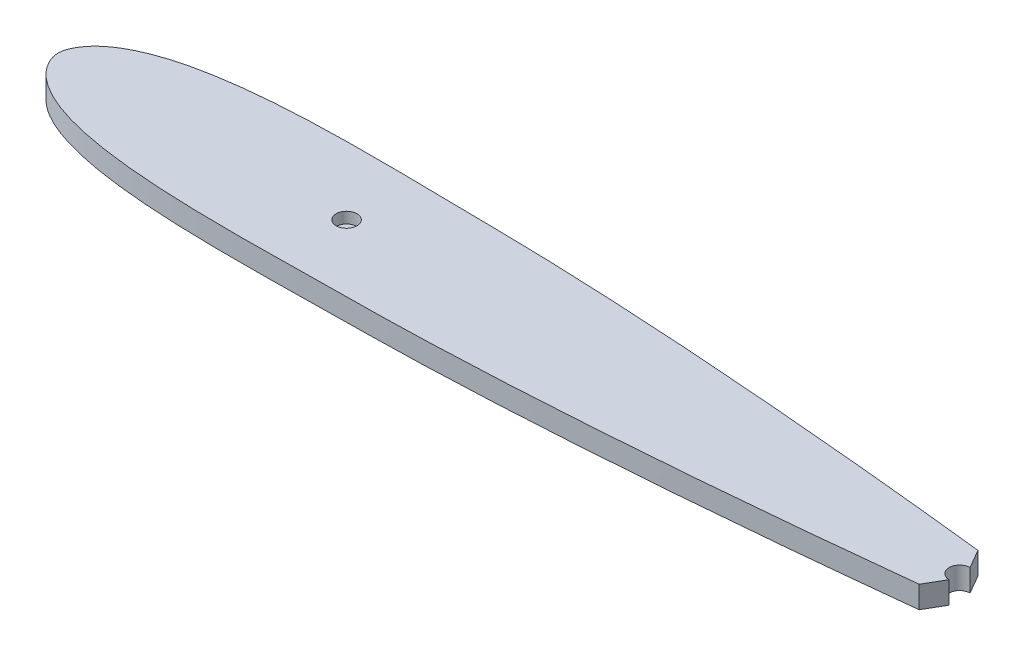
ISO-10303-21;
HEADER;
FILE_DESCRIPTION(('STEP AP214'),'2;1');
FILE_NAME('part.step','',(''),(''),'','','');
FILE_SCHEMA(('AUTOMOTIVE_DESIGN { 1 0 10303 214 1 1 1 1 }'));
ENDSEC;
DATA;
#1=APPLICATION_CONTEXT('core data for automotive mechanical design processes');
#2=APPLICATION_PROTOCOL_DEFINITION('international standard','automotive_design',2000,#1);
#3=PRODUCT_CONTEXT('',#1,'mechanical');
#4=PRODUCT('Part','Part','',(#3));
#5=PRODUCT_RELATED_PRODUCT_CATEGORY('part','',(#4));
#6=PRODUCT_DEFINITION_FORMATION('','',#4);
#7=PRODUCT_DEFINITION_CONTEXT('part definition',#1,'design');
#8=PRODUCT_DEFINITION('design','',#6,#7);
#9=PRODUCT_DEFINITION_SHAPE('','',#8);
#10=(LENGTH_UNIT() NAMED_UNIT(*) SI_UNIT(.MILLI.,.METRE.));
#11=(NAMED_UNIT(*) PLANE_ANGLE_UNIT() SI_UNIT($,.RADIAN.));
#12=(NAMED_UNIT(*) SI_UNIT($,.STERADIAN.) SOLID_ANGLE_UNIT());
#13=UNCERTAINTY_MEASURE_WITH_UNIT(LENGTH_MEASURE(1.E-05),#10,'distance_accuracy_value','');
#14=(GEOMETRIC_REPRESENTATION_CONTEXT(3) GLOBAL_UNCERTAINTY_ASSIGNED_CONTEXT((#13)) GLOBAL_UNIT_ASSIGNED_CONTEXT((#10,
#11,#12)) REPRESENTATION_CONTEXT('',''));
#15=CARTESIAN_POINT('',(0.,0.,0.));
#16=DIRECTION('',(0.,0.,1.));
#17=DIRECTION('',(1.,0.,0.));
#18=AXIS2_PLACEMENT_3D('',#15,#16,#17);
#19=CARTESIAN_POINT('',(71.9303295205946,3.175,9.05132511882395));
#20=CARTESIAN_POINT('',(68.7965776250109,3.175,8.61956797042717));
#21=CARTESIAN_POINT('',(63.0002977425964,3.175,7.81474895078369));
#22=CARTESIAN_POINT('',(54.5308232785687,3.175,6.73460749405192));
#23=CARTESIAN_POINT('',(46.5307338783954,3.175,5.76534614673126));
#24=CARTESIAN_POINT('',(35.8673006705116,3.175,4.55122731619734));
#25=CARTESIAN_POINT('',(25.2003793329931,3.175,3.43921565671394));
#26=CARTESIAN_POINT('',(14.5302482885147,3.175,2.43625042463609));
#27=CARTESIAN_POINT('',(6.53007867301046,3.175,1.74840973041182));
#28=CARTESIAN_POINT('',(-1.46980129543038,3.175,1.12357332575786));
#29=CARTESIAN_POINT('',(-9.52320260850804,3.175,0.572586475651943));
#30=CARTESIAN_POINT('',(-17.5763627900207,3.175,0.101076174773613));
#31=CARTESIAN_POINT('',(-25.6303780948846,3.175,-0.248033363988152));
#32=CARTESIAN_POINT('',(-33.6309033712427,3.175,-0.505985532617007));
#33=CARTESIAN_POINT('',(-40.2464909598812,3.175,-0.501477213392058));
#34=CARTESIAN_POINT('',(-45.5256833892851,3.175,-0.624417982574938));
#35=CARTESIAN_POINT('',(-52.1391605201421,3.175,-0.716510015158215));
#36=CARTESIAN_POINT('',(-60.146425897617,3.175,-0.720540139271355));
#37=CARTESIAN_POINT('',(-68.1528825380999,3.175,-0.297734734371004));
#38=CARTESIAN_POINT('',(-73.218636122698,3.175,0.266196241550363));
#39=CARTESIAN_POINT('',(-76.6922015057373,3.175,0.835754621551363));
#40=CARTESIAN_POINT('',(-79.3610346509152,3.175,1.4431133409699));
#41=CARTESIAN_POINT('',(-81.4880549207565,3.175,2.08619509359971));
#42=CARTESIAN_POINT('',(-83.097950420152,3.175,2.67459227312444));
#43=CARTESIAN_POINT('',(-84.7173066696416,3.175,3.41241294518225));
#44=CARTESIAN_POINT('',(-86.3653410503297,3.175,4.37917231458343));
#45=CARTESIAN_POINT('',(-87.7324281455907,3.175,5.50979611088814));
#46=CARTESIAN_POINT('',(-88.9364396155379,3.175,7.02318606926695));
#47=CARTESIAN_POINT('',(-89.8226502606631,3.175,9.05948987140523));
#48=CARTESIAN_POINT('',(-88.9364396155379,3.175,11.0957936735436));
#49=CARTESIAN_POINT('',(-87.7324281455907,3.175,12.6091836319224));
#50=CARTESIAN_POINT('',(-86.3653410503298,3.175,13.7398074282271));
#51=CARTESIAN_POINT('',(-84.7173066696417,3.175,14.7065667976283));
#52=CARTESIAN_POINT('',(-83.0979504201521,3.175,15.4443874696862));
#53=CARTESIAN_POINT('',(-81.4880549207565,3.175,16.032784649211));
#54=CARTESIAN_POINT('',(-79.3610346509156,3.175,16.6758664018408));
#55=CARTESIAN_POINT('',(-76.6922015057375,3.175,17.2832251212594));
#56=CARTESIAN_POINT('',(-73.2186361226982,3.175,17.8527835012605));
#57=CARTESIAN_POINT('',(-68.1528825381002,3.175,18.416714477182));
#58=CARTESIAN_POINT('',(-60.1464258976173,3.175,18.8395198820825));
#59=CARTESIAN_POINT('',(-52.1391605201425,3.175,18.8354897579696));
#60=CARTESIAN_POINT('',(-45.5256833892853,3.175,18.7433977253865));
#61=CARTESIAN_POINT('',(-40.2464909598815,3.175,18.6204569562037));
#62=CARTESIAN_POINT('',(-33.6309033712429,3.175,18.6249652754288));
#63=CARTESIAN_POINT('',(-25.6303780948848,3.175,18.3670131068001));
#64=CARTESIAN_POINT('',(-17.576362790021,3.175,18.0179035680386));
#65=CARTESIAN_POINT('',(-9.52320260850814,3.175,17.5463932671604));
#66=CARTESIAN_POINT('',(-1.46980129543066,3.175,16.9954064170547));
#67=CARTESIAN_POINT('',(6.53007867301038,3.175,16.3705700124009));
#68=CARTESIAN_POINT('',(14.5302482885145,3.175,15.6827293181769));
#69=CARTESIAN_POINT('',(25.200379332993,3.175,14.6797640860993));
#70=CARTESIAN_POINT('',(35.8673006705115,3.175,13.5677524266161));
#71=CARTESIAN_POINT('',(46.5307338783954,3.175,12.3536335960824));
#72=CARTESIAN_POINT('',(54.5308232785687,3.175,11.384372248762));
#73=CARTESIAN_POINT('',(63.0074894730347,3.175,10.3033136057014));
#74=CARTESIAN_POINT('',(68.8109397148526,3.175,9.49741748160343));
#75=CARTESIAN_POINT('',(71.9518757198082,3.175,9.06468611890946));
#76=B_SPLINE_CURVE_WITH_KNOTS('',3,(#19,#20,#21,#22,#23,#24,#25,#26,#27,#28,#29,#30,#31,#32,#33,
#34,#35,#36,#37,#38,#39,#40,#41,#42,#43,#44,#45,#46,#47,#48,#49,#50,#51,#52,#53,#54,#55,#56,#57,
#58,#59,#60,#61,#62,#63,#64,#65,#66,#67,#68,#69,#70,#71,#72,#73,#74,#75),.UNSPECIFIED.,.F.,.F.,
(4,1,1,1,1,1,1,1,1,1,1,1,1,1,1,1,1,1,1,1,1,1,1,1,1,1,1,1,1,1,1,1,1,1,1,1,1,1,1,1,1,1,1,1,1,1,1,
1,1,1,1,1,1,1,4),(-0.00432084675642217,0.0246342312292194,0.0492428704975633,0.0738297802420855,
0.0983967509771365,0.147478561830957,0.171994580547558,0.196493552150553,0.220976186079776,
0.245442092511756,0.270380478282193,0.29481296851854,0.319231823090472,0.343641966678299,
0.355360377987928,0.367566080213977,0.404182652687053,0.428636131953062,0.440920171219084,
0.450818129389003,0.460843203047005,0.465945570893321,0.471149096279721,0.476522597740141,
0.482208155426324,0.488618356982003,0.492567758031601,0.5,0.507432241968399,0.511381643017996,
0.517791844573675,0.523477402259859,0.528850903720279,0.534054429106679,0.539156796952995,
0.549181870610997,0.559079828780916,0.571363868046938,0.595817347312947,0.632433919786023,
0.644639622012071,0.656358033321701,0.680768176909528,0.70518703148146,0.729619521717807,
0.754557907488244,0.779023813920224,0.803506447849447,0.828005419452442,0.852521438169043,
0.901603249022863,0.926170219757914,0.950757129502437,0.975365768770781,1.00438720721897),.UNSPECIFIED.);
#77=DIRECTION('',(0.,-1.,0.));
#78=VECTOR('',#77,1.);
#79=SURFACE_OF_LINEAR_EXTRUSION('',#76,#78);
#80=CARTESIAN_POINT('',(38.3577033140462,3.175,13.2750867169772));
#81=CARTESIAN_POINT('',(33.0845333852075,3.175,13.8578479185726));
#82=CARTESIAN_POINT('',(25.1437049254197,3.175,14.6850913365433));
#83=CARTESIAN_POINT('',(14.5302482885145,3.175,15.6827293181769));
#84=CARTESIAN_POINT('',(6.53007867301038,3.175,16.3705700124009));
#85=CARTESIAN_POINT('',(-1.46980129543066,3.175,16.9954064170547));
#86=CARTESIAN_POINT('',(-9.52320260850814,3.175,17.5463932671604));
#87=CARTESIAN_POINT('',(-17.576362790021,3.175,18.0179035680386));
#88=CARTESIAN_POINT('',(-25.6303780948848,3.175,18.3670131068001));
#89=CARTESIAN_POINT('',(-33.6309033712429,3.175,18.6249652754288));
#90=CARTESIAN_POINT('',(-40.2464909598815,3.175,18.6204569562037));
#91=CARTESIAN_POINT('',(-45.5256833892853,3.175,18.7433977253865));
#92=CARTESIAN_POINT('',(-52.1391605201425,3.175,18.8354897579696));
#93=CARTESIAN_POINT('',(-60.1464258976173,3.175,18.8395198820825));
#94=CARTESIAN_POINT('',(-68.1528825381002,3.175,18.416714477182));
#95=CARTESIAN_POINT('',(-73.2186361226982,3.175,17.8527835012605));
#96=CARTESIAN_POINT('',(-76.6922015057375,3.175,17.2832251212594));
#97=CARTESIAN_POINT('',(-79.3610346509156,3.175,16.6758664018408));
#98=CARTESIAN_POINT('',(-81.4880549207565,3.175,16.032784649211));
#99=CARTESIAN_POINT('',(-83.0979504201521,3.175,15.4443874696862));
#100=CARTESIAN_POINT('',(-84.7173066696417,3.175,14.7065667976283));
#101=CARTESIAN_POINT('',(-86.3653410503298,3.175,13.7398074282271));
#102=CARTESIAN_POINT('',(-87.7324281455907,3.175,12.6091836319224));
#103=CARTESIAN_POINT('',(-88.9364396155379,3.175,11.0957936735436));
#104=CARTESIAN_POINT('',(-89.8226502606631,3.175,9.05948987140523));
#105=CARTESIAN_POINT('',(-88.9364396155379,3.175,7.02318606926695));
#106=CARTESIAN_POINT('',(-87.7324281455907,3.175,5.50979611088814));
#107=CARTESIAN_POINT('',(-86.3653410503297,3.175,4.37917231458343));
#108=CARTESIAN_POINT('',(-84.7173066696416,3.175,3.41241294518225));
#109=CARTESIAN_POINT('',(-83.097950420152,3.175,2.67459227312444));
#110=CARTESIAN_POINT('',(-81.4880549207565,3.175,2.08619509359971));
#111=CARTESIAN_POINT('',(-79.3610346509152,3.175,1.4431133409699));
#112=CARTESIAN_POINT('',(-76.6922015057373,3.175,0.835754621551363));
#113=CARTESIAN_POINT('',(-73.218636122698,3.175,0.266196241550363));
#114=CARTESIAN_POINT('',(-68.1528825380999,3.175,-0.297734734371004));
#115=CARTESIAN_POINT('',(-60.146425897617,3.175,-0.720540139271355));
#116=CARTESIAN_POINT('',(-52.1391605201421,3.175,-0.716510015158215));
#117=CARTESIAN_POINT('',(-45.5256833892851,3.175,-0.624417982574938));
#118=CARTESIAN_POINT('',(-40.2464909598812,3.175,-0.501477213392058));
#119=CARTESIAN_POINT('',(-33.6309033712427,3.175,-0.505985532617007));
#120=CARTESIAN_POINT('',(-25.6303780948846,3.175,-0.248033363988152));
#121=CARTESIAN_POINT('',(-17.5763627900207,3.175,0.101076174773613));
#122=CARTESIAN_POINT('',(-9.52320260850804,3.175,0.572586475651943));
#123=CARTESIAN_POINT('',(-1.46980129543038,3.175,1.12357332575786));
#124=CARTESIAN_POINT('',(6.53007867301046,3.175,1.74840973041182));
#125=CARTESIAN_POINT('',(14.5302482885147,3.175,2.43625042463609));
#126=CARTESIAN_POINT('',(25.1470671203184,3.175,3.43420444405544));
#127=CARTESIAN_POINT('',(33.0912511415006,3.175,4.26183166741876));
#128=CARTESIAN_POINT('',(38.3677729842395,3.175,4.84500591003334));
#129=B_SPLINE_CURVE_WITH_KNOTS('',3,(#80,#81,#82,#83,#84,#85,#86,#87,#88,#89,#90,#91,#92,#93,
#94,#95,#96,#97,#98,#99,#100,#101,#102,#103,#104,#105,#106,#107,#108,#109,#110,#111,#112,#113,
#114,#115,#116,#117,#118,#119,#120,#121,#122,#123,#124,#125,#126,#127,#128),.UNSPECIFIED.,.F.,
.F.,(4,1,1,1,1,1,1,1,1,1,1,1,1,1,1,1,1,1,1,1,1,1,1,1,1,1,1,1,1,1,1,1,1,1,1,1,1,1,1,1,1,1,1,1,1,
1,4),(0.0988868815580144,0.147447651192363,0.171963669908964,0.196462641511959,
0.220945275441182,0.245411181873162,0.270349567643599,0.294782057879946,0.319200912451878,
0.343611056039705,0.355329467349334,0.367535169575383,0.404151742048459,0.428605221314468,
0.44088926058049,0.450787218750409,0.460812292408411,0.465914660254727,0.471118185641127,
0.476491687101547,0.48217724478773,0.488587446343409,0.492536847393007,0.499969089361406,
0.507401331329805,0.511350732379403,0.517760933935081,0.523446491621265,0.528819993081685,
0.534023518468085,0.539125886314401,0.549150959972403,0.559048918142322,0.571332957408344,
0.595786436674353,0.632403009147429,0.644608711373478,0.656327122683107,0.680737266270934,
0.705156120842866,0.729588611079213,0.75452699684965,0.77899290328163,0.803475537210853,
0.827974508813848,0.852490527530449,0.901082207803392),.UNSPECIFIED.);
#130=CARTESIAN_POINT('',(38.3677830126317,3.175,4.84491517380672));
#131=VERTEX_POINT('',#130);
#132=CARTESIAN_POINT('',(38.357713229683,3.175,13.2751764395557));
#133=VERTEX_POINT('',#132);
#134=EDGE_CURVE('E11',#131,#133,#129,.F.);
#135=ORIENTED_EDGE('',*,*,#134,.F.);
#136=DIRECTION('',(0.,-1.,0.));
#137=VECTOR('',#136,1.);
#138=CARTESIAN_POINT('',(38.3678396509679,1.5874875,4.84501327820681));
#139=LINE('',#138,#137);
#140=CARTESIAN_POINT('',(38.3678396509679,-1.25000000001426E-05,4.84501327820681));
#141=VERTEX_POINT('',#140);
#142=EDGE_CURVE('E95',#141,#131,#139,.F.);
#143=ORIENTED_EDGE('',*,*,#142,.F.);
#144=CARTESIAN_POINT('',(71.9303295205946,0.,9.05132511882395));
#145=CARTESIAN_POINT('',(68.7965776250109,0.,8.61956797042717));
#146=CARTESIAN_POINT('',(63.0002977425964,0.,7.81474895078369));
#147=CARTESIAN_POINT('',(54.5308232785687,0.,6.73460749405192));
#148=CARTESIAN_POINT('',(46.5307338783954,0.,5.76534614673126));
#149=CARTESIAN_POINT('',(35.8673006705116,0.,4.55122731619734));
#150=CARTESIAN_POINT('',(25.2003793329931,0.,3.43921565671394));
#151=CARTESIAN_POINT('',(14.5302482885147,0.,2.43625042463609));
#152=CARTESIAN_POINT('',(6.53007867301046,0.,1.74840973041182));
#153=CARTESIAN_POINT('',(-1.46980129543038,0.,1.12357332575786));
#154=CARTESIAN_POINT('',(-9.52320260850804,0.,0.572586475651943));
#155=CARTESIAN_POINT('',(-17.5763627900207,0.,0.101076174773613));
#156=CARTESIAN_POINT('',(-25.6303780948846,0.,-0.248033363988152));
#157=CARTESIAN_POINT('',(-33.6309033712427,0.,-0.505985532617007));
#158=CARTESIAN_POINT('',(-40.2464909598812,0.,-0.501477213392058));
#159=CARTESIAN_POINT('',(-45.5256833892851,0.,-0.624417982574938));
#160=CARTESIAN_POINT('',(-52.1391605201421,0.,-0.716510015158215));
#161=CARTESIAN_POINT('',(-60.146425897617,0.,-0.720540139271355));
#162=CARTESIAN_POINT('',(-68.1528825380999,0.,-0.297734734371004));
#163=CARTESIAN_POINT('',(-73.218636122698,0.,0.266196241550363));
#164=CARTESIAN_POINT('',(-76.6922015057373,0.,0.835754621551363));
#165=CARTESIAN_POINT('',(-79.3610346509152,0.,1.4431133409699));
#166=CARTESIAN_POINT('',(-81.4880549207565,0.,2.08619509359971));
#167=CARTESIAN_POINT('',(-83.097950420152,0.,2.67459227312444));
#168=CARTESIAN_POINT('',(-84.7173066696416,0.,3.41241294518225));
#169=CARTESIAN_POINT('',(-86.3653410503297,0.,4.37917231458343));
#170=CARTESIAN_POINT('',(-87.7324281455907,0.,5.50979611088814));
#171=CARTESIAN_POINT('',(-88.9364396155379,0.,7.02318606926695));
#172=CARTESIAN_POINT('',(-89.8226502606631,0.,9.05948987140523));
#173=CARTESIAN_POINT('',(-88.9364396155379,0.,11.0957936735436));
#174=CARTESIAN_POINT('',(-87.7324281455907,0.,12.6091836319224));
#175=CARTESIAN_POINT('',(-86.3653410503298,0.,13.7398074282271));
#176=CARTESIAN_POINT('',(-84.7173066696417,0.,14.7065667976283));
#177=CARTESIAN_POINT('',(-83.0979504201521,0.,15.4443874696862));
#178=CARTESIAN_POINT('',(-81.4880549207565,0.,16.032784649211));
#179=CARTESIAN_POINT('',(-79.3610346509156,0.,16.6758664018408));
#180=CARTESIAN_POINT('',(-76.6922015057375,0.,17.2832251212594));
#181=CARTESIAN_POINT('',(-73.2186361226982,0.,17.8527835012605));
#182=CARTESIAN_POINT('',(-68.1528825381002,0.,18.416714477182));
#183=CARTESIAN_POINT('',(-60.1464258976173,0.,18.8395198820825));
#184=CARTESIAN_POINT('',(-52.1391605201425,0.,18.8354897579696));
#185=CARTESIAN_POINT('',(-45.5256833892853,0.,18.7433977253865));
#186=CARTESIAN_POINT('',(-40.2464909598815,0.,18.6204569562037));
#187=CARTESIAN_POINT('',(-33.6309033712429,0.,18.6249652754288));
#188=CARTESIAN_POINT('',(-25.6303780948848,0.,18.3670131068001));
#189=CARTESIAN_POINT('',(-17.576362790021,0.,18.0179035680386));
#190=CARTESIAN_POINT('',(-9.52320260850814,0.,17.5463932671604));
#191=CARTESIAN_POINT('',(-1.46980129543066,0.,16.9954064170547));
#192=CARTESIAN_POINT('',(6.53007867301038,0.,16.3705700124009));
#193=CARTESIAN_POINT('',(14.5302482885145,0.,15.6827293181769));
#194=CARTESIAN_POINT('',(25.200379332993,0.,14.6797640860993));
#195=CARTESIAN_POINT('',(35.8673006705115,0.,13.5677524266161));
#196=CARTESIAN_POINT('',(46.5307338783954,0.,12.3536335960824));
#197=CARTESIAN_POINT('',(54.5308232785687,0.,11.384372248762));
#198=CARTESIAN_POINT('',(63.0074894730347,0.,10.3033136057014));
#199=CARTESIAN_POINT('',(68.8109397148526,0.,9.49741748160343));
#200=CARTESIAN_POINT('',(71.9518757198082,0.,9.06468611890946));
#201=B_SPLINE_CURVE_WITH_KNOTS('',3,(#144,#145,#146,#147,#148,#149,#150,#151,#152,#153,#154,
#155,#156,#157,#158,#159,#160,#161,#162,#163,#164,#165,#166,#167,#168,#169,#170,#171,#172,#173,
#174,#175,#176,#177,#178,#179,#180,#181,#182,#183,#184,#185,#186,#187,#188,#189,#190,#191,#192,
#193,#194,#195,#196,#197,#198,#199,#200),.UNSPECIFIED.,.F.,.F.,(4,1,1,1,1,1,1,1,1,1,1,1,1,1,1,1,
1,1,1,1,1,1,1,1,1,1,1,1,1,1,1,1,1,1,1,1,1,1,1,1,1,1,1,1,1,1,1,1,1,1,1,1,1,1,4),
(-0.00432084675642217,0.0246342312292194,0.0492428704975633,0.0738297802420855,
0.0983967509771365,0.147478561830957,0.171994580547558,0.196493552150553,0.220976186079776,
0.245442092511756,0.270380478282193,0.29481296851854,0.319231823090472,0.343641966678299,
0.355360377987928,0.367566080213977,0.404182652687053,0.428636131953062,0.440920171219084,
0.450818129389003,0.460843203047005,0.465945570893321,0.471149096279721,0.476522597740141,
0.482208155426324,0.488618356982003,0.492567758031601,0.5,0.507432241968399,0.511381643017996,
0.517791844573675,0.523477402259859,0.528850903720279,0.534054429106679,0.539156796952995,
0.549181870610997,0.559079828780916,0.571363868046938,0.595817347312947,0.632433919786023,
0.644639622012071,0.656358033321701,0.680768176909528,0.70518703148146,0.729619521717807,
0.754557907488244,0.779023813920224,0.803506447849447,0.828005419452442,0.852521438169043,
0.901603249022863,0.926170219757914,0.950757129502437,0.975365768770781,1.00438720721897),.UNSPECIFIED.);
#202=CARTESIAN_POINT('',(38.3577692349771,-1.25000000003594E-05,13.2750794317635));
#203=VERTEX_POINT('',#202);
#204=EDGE_CURVE('E61',#141,#203,#201,.T.);
#205=ORIENTED_EDGE('',*,*,#204,.T.);
#206=DIRECTION('',(0.,-1.,0.));
#207=VECTOR('',#206,1.);
#208=CARTESIAN_POINT('',(38.3577692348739,1.5874875,13.2750794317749));
#209=LINE('',#208,#207);
#210=EDGE_CURVE('E108',#203,#133,#209,.F.);
#211=ORIENTED_EDGE('',*,*,#210,.T.);
#212=EDGE_LOOP('',(#135,#143,#205,#211));
#213=FACE_BOUND('',#212,.T.);
#214=ADVANCED_FACE('F49',(#213),#79,.F.);
#215=CARTESIAN_POINT('',(-89.4725404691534,3.175,9.07026355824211));
#216=DIRECTION('',(0.,1.,0.));
#217=DIRECTION('',(0.,0.,1.));
#218=AXIS2_PLACEMENT_3D('',#215,#216,#217);
#219=PLANE('',#218);
#220=DIRECTION('',(0.499999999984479,0.,0.8660254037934));
#221=VECTOR('',#220,1.);
#222=CARTESIAN_POINT('',(8.23733166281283,3.175,-47.3425574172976));
#223=LINE('',#222,#221);
#224=CARTESIAN_POINT('',(39.9303295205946,3.175,7.55132511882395));
#225=VERTEX_POINT('',#224);
#226=EDGE_CURVE('E68',#131,#225,#223,.T.);
#227=ORIENTED_EDGE('',*,*,#226,.F.);
#228=ORIENTED_EDGE('',*,*,#134,.T.);
#229=DIRECTION('',(-0.499999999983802,0.,0.866025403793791));
#230=VECTOR('',#229,1.);
#231=CARTESIAN_POINT('',(8.22093049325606,3.175,65.4736153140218));
#232=LINE('',#231,#230);
#233=CARTESIAN_POINT('',(39.9303295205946,3.175,10.551325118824));
#234=VERTEX_POINT('',#233);
#235=EDGE_CURVE('E102',#234,#133,#232,.T.);
#236=ORIENTED_EDGE('',*,*,#235,.F.);
#237=CARTESIAN_POINT('',(39.9303295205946,3.175,9.05132511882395));
#238=DIRECTION('',(0.,1.,0.));
#239=DIRECTION('',(0.,0.,1.));
#240=AXIS2_PLACEMENT_3D('',#237,#238,#239);
#241=CIRCLE('',#240,1.5);
#242=EDGE_CURVE('E116',#225,#234,#241,.T.);
#243=ORIENTED_EDGE('',*,*,#242,.F.);
#244=EDGE_LOOP('',(#227,#228,#236,#243));
#245=FACE_BOUND('',#244,.T.);
#246=CARTESIAN_POINT('',(-48.0481242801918,3.175,9.06468611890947));
#247=DIRECTION('',(0.,1.,0.));
#248=DIRECTION('',(0.,0.,1.));
#249=AXIS2_PLACEMENT_3D('',#246,#247,#248);
#250=CIRCLE('',#249,1.5);
#251=CARTESIAN_POINT('',(-48.0481242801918,3.175,10.5646861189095));
#252=VERTEX_POINT('',#251);
#253=EDGE_CURVE('E258',#252,#252,#250,.T.);
#254=ORIENTED_EDGE('',*,*,#253,.F.);
#255=EDGE_LOOP('',(#254));
#256=FACE_BOUND('',#255,.T.);
#257=ADVANCED_FACE('F135',(#245,#256),#219,.T.);
#258=CARTESIAN_POINT('',(-89.4725404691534,0.,9.07026355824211));
#259=DIRECTION('',(0.,1.,0.));
#260=DIRECTION('',(0.,0.,1.));
#261=AXIS2_PLACEMENT_3D('',#258,#259,#260);
#262=PLANE('',#261);
#263=CARTESIAN_POINT('',(-73.2696704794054,0.,9.05132511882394));
#264=DIRECTION('',(0.,-1.,0.));
#265=DIRECTION('',(0.,0.,-1.));
#266=AXIS2_PLACEMENT_3D('',#263,#264,#265);
#267=CIRCLE('',#266,1.5);
#268=CARTESIAN_POINT('',(-73.2696704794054,0.,7.55132511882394));
#269=VERTEX_POINT('',#268);
#270=EDGE_CURVE('E253',#269,#269,#267,.T.);
#271=ORIENTED_EDGE('',*,*,#270,.F.);
#272=EDGE_LOOP('',(#271));
#273=FACE_BOUND('',#272,.T.);
#274=ORIENTED_EDGE('',*,*,#204,.F.);
#275=DIRECTION('',(0.499999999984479,0.,0.8660254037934));
#276=VECTOR('',#275,1.);
#277=CARTESIAN_POINT('',(8.23733166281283,0.,-47.3425574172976));
#278=LINE('',#277,#276);
#279=CARTESIAN_POINT('',(39.9303295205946,0.,7.55132511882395));
#280=VERTEX_POINT('',#279);
#281=EDGE_CURVE('E92',#141,#280,#278,.T.);
#282=ORIENTED_EDGE('',*,*,#281,.T.);
#283=CARTESIAN_POINT('',(39.9303295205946,0.,9.05132511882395));
#284=DIRECTION('',(0.,1.,0.));
#285=DIRECTION('',(0.,0.,1.));
#286=AXIS2_PLACEMENT_3D('',#283,#284,#285);
#287=CIRCLE('',#286,1.5);
#288=CARTESIAN_POINT('',(39.9303295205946,0.,10.551325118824));
#289=VERTEX_POINT('',#288);
#290=EDGE_CURVE('E112',#280,#289,#287,.T.);
#291=ORIENTED_EDGE('',*,*,#290,.T.);
#292=DIRECTION('',(-0.499999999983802,0.,0.866025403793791));
#293=VECTOR('',#292,1.);
#294=CARTESIAN_POINT('',(8.22093049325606,0.,65.4736153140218));
#295=LINE('',#294,#293);
#296=EDGE_CURVE('E76',#289,#203,#295,.T.);
#297=ORIENTED_EDGE('',*,*,#296,.T.);
#298=EDGE_LOOP('',(#274,#282,#291,#297));
#299=FACE_BOUND('',#298,.T.);
#300=ADVANCED_FACE('F110',(#273,#299),#262,.F.);
#301=CARTESIAN_POINT('',(39.9303295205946,0.,9.05132511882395));
#302=DIRECTION('',(0.,1.,0.));
#303=DIRECTION('',(0.,0.,1.));
#304=AXIS2_PLACEMENT_3D('',#301,#302,#303);
#305=CYLINDRICAL_SURFACE('',#304,1.5);
#306=ORIENTED_EDGE('',*,*,#242,.T.);
#307=DIRECTION('',(0.,1.,0.));
#308=VECTOR('',#307,1.);
#309=CARTESIAN_POINT('',(39.9303295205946,0.,10.551325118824));
#310=LINE('',#309,#308);
#311=EDGE_CURVE('E233',#289,#234,#310,.T.);
#312=ORIENTED_EDGE('',*,*,#311,.F.);
#313=ORIENTED_EDGE('',*,*,#290,.F.);
#314=DIRECTION('',(0.,1.,0.));
#315=VECTOR('',#314,1.);
#316=CARTESIAN_POINT('',(39.9303295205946,0.,7.55132511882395));
#317=LINE('',#316,#315);
#318=EDGE_CURVE('E96',#280,#225,#317,.T.);
#319=ORIENTED_EDGE('',*,*,#318,.T.);
#320=EDGE_LOOP('',(#306,#312,#313,#319));
#321=FACE_BOUND('',#320,.T.);
#322=ADVANCED_FACE('F145',(#321),#305,.F.);
#323=CARTESIAN_POINT('',(-48.0481242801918,1.5875,9.06468611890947));
#324=DIRECTION('',(0.,1.,0.));
#325=DIRECTION('',(0.,0.,1.));
#326=AXIS2_PLACEMENT_3D('',#323,#324,#325);
#327=CYLINDRICAL_SURFACE('',#326,1.5);
#328=CARTESIAN_POINT('',(-48.0481242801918,1.5875,9.06468611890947));
#329=DIRECTION('',(0.,1.,0.));
#330=DIRECTION('',(0.,0.,1.));
#331=AXIS2_PLACEMENT_3D('',#328,#329,#330);
#332=CIRCLE('',#331,1.5);
#333=CARTESIAN_POINT('',(-48.0481242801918,1.5875,10.5646861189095));
#334=VERTEX_POINT('',#333);
#335=EDGE_CURVE('E262',#334,#334,#332,.T.);
#336=ORIENTED_EDGE('',*,*,#335,.F.);
#337=EDGE_LOOP('',(#336));
#338=FACE_BOUND('',#337,.T.);
#339=ORIENTED_EDGE('',*,*,#253,.T.);
#340=EDGE_LOOP('',(#339));
#341=FACE_BOUND('',#340,.T.);
#342=ADVANCED_FACE('F152',(#338,#341),#327,.F.);
#343=CARTESIAN_POINT('',(-48.0481242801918,1.5875,9.06468611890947));
#344=DIRECTION('',(0.,1.,0.));
#345=DIRECTION('',(0.,0.,1.));
#346=AXIS2_PLACEMENT_3D('',#343,#344,#345);
#347=PLANE('',#346);
#348=ORIENTED_EDGE('',*,*,#335,.T.);
#349=EDGE_LOOP('',(#348));
#350=FACE_BOUND('',#349,.T.);
#351=ADVANCED_FACE('F189',(#350),#347,.T.);
#352=CARTESIAN_POINT('',(-73.2696704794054,1.5875,9.05132511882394));
#353=DIRECTION('',(0.,-1.,0.));
#354=DIRECTION('',(0.,0.,-1.));
#355=AXIS2_PLACEMENT_3D('',#352,#353,#354);
#356=CYLINDRICAL_SURFACE('',#355,1.5);
#357=CARTESIAN_POINT('',(-73.2696704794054,1.5875,9.05132511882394));
#358=DIRECTION('',(0.,-1.,0.));
#359=DIRECTION('',(0.,0.,-1.));
#360=AXIS2_PLACEMENT_3D('',#357,#358,#359);
#361=CIRCLE('',#360,1.5);
#362=CARTESIAN_POINT('',(-73.2696704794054,1.5875,7.55132511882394));
#363=VERTEX_POINT('',#362);
#364=EDGE_CURVE('E254',#363,#363,#361,.T.);
#365=ORIENTED_EDGE('',*,*,#364,.F.);
#366=EDGE_LOOP('',(#365));
#367=FACE_BOUND('',#366,.T.);
#368=ORIENTED_EDGE('',*,*,#270,.T.);
#369=EDGE_LOOP('',(#368));
#370=FACE_BOUND('',#369,.T.);
#371=ADVANCED_FACE('F198',(#367,#370),#356,.F.);
#372=CARTESIAN_POINT('',(-73.2696704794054,1.5875,9.05132511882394));
#373=DIRECTION('',(0.,-1.,0.));
#374=DIRECTION('',(0.,0.,-1.));
#375=AXIS2_PLACEMENT_3D('',#372,#373,#374);
#376=PLANE('',#375);
#377=ORIENTED_EDGE('',*,*,#364,.T.);
#378=EDGE_LOOP('',(#377));
#379=FACE_BOUND('',#378,.T.);
#380=ADVANCED_FACE('F163',(#379),#376,.T.);
#381=CARTESIAN_POINT('',(39.9303295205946,-2.49999999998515E-05,10.551325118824));
#382=DIRECTION('',(-0.866025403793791,0.,-0.499999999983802));
#383=DIRECTION('',(-0.499999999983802,0.,0.866025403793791));
#384=AXIS2_PLACEMENT_3D('',#381,#382,#383);
#385=PLANE('',#384);
#386=ORIENTED_EDGE('',*,*,#235,.T.);
#387=ORIENTED_EDGE('',*,*,#210,.F.);
#388=ORIENTED_EDGE('',*,*,#296,.F.);
#389=ORIENTED_EDGE('',*,*,#311,.T.);
#390=EDGE_LOOP('',(#386,#387,#388,#389));
#391=FACE_BOUND('',#390,.T.);
#392=ADVANCED_FACE('F214',(#391),#385,.F.);
#393=CARTESIAN_POINT('',(39.9303295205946,-2.49999999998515E-05,7.55132511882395));
#394=DIRECTION('',(-0.8660254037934,0.,0.499999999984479));
#395=DIRECTION('',(0.499999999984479,0.,0.8660254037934));
#396=AXIS2_PLACEMENT_3D('',#393,#394,#395);
#397=PLANE('',#396);
#398=ORIENTED_EDGE('',*,*,#226,.T.);
#399=ORIENTED_EDGE('',*,*,#318,.F.);
#400=ORIENTED_EDGE('',*,*,#281,.F.);
#401=ORIENTED_EDGE('',*,*,#142,.T.);
#402=EDGE_LOOP('',(#398,#399,#400,#401));
#403=FACE_BOUND('',#402,.T.);
#404=ADVANCED_FACE('F94',(#403),#397,.F.);
#405=CLOSED_SHELL('',(#214,#257,#300,#322,#342,#351,#371,#380,#392,#404));
#406=MANIFOLD_SOLID_BREP('B2',#405);
#407=ADVANCED_BREP_SHAPE_REPRESENTATION('',(#18,#406),#14);
#408=SHAPE_DEFINITION_REPRESENTATION(#9,#407);
ENDSEC;
END-ISO-10303-21;
